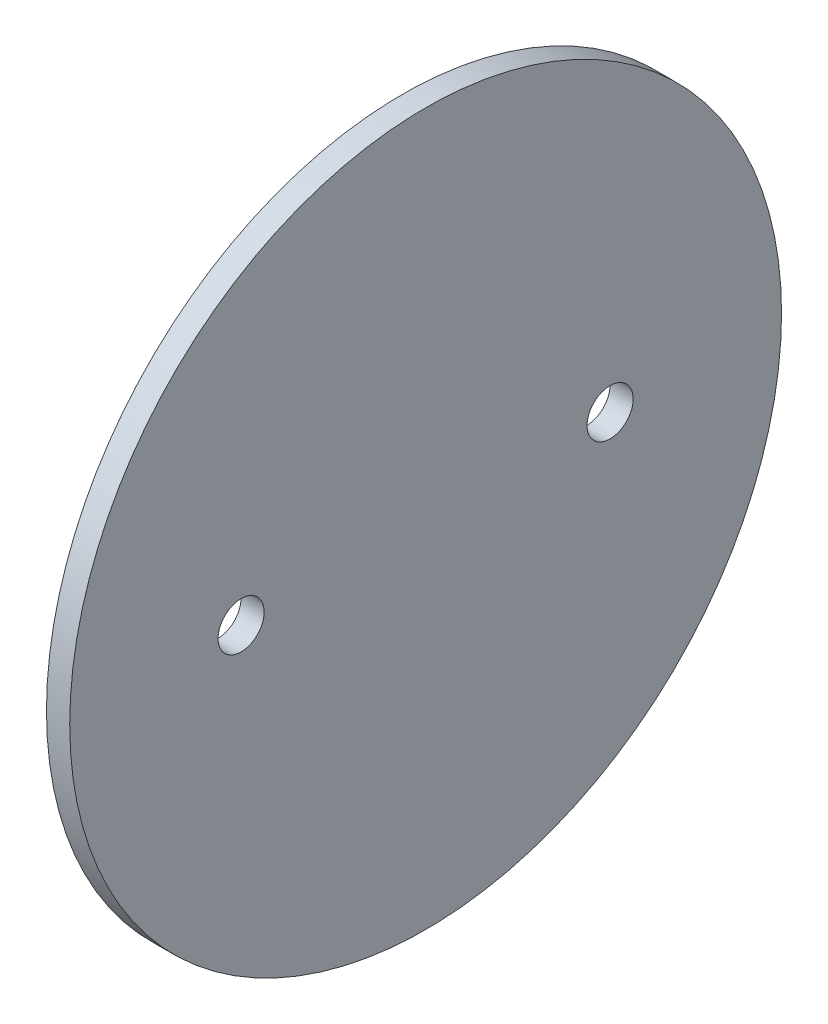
ISO-10303-21;
HEADER;
FILE_DESCRIPTION(('STEP AP214'),'2;1');
FILE_NAME('part.step','',(''),(''),'','','');
FILE_SCHEMA(('AUTOMOTIVE_DESIGN { 1 0 10303 214 1 1 1 1 }'));
ENDSEC;
DATA;
#1=APPLICATION_CONTEXT('core data for automotive mechanical design processes');
#2=APPLICATION_PROTOCOL_DEFINITION('international standard','automotive_design',2000,#1);
#3=PRODUCT_CONTEXT('',#1,'mechanical');
#4=PRODUCT('Part','Part','',(#3));
#5=PRODUCT_RELATED_PRODUCT_CATEGORY('part','',(#4));
#6=PRODUCT_DEFINITION_FORMATION('','',#4);
#7=PRODUCT_DEFINITION_CONTEXT('part definition',#1,'design');
#8=PRODUCT_DEFINITION('design','',#6,#7);
#9=PRODUCT_DEFINITION_SHAPE('','',#8);
#10=(LENGTH_UNIT() NAMED_UNIT(*) SI_UNIT(.MILLI.,.METRE.));
#11=(NAMED_UNIT(*) PLANE_ANGLE_UNIT() SI_UNIT($,.RADIAN.));
#12=(NAMED_UNIT(*) SI_UNIT($,.STERADIAN.) SOLID_ANGLE_UNIT());
#13=UNCERTAINTY_MEASURE_WITH_UNIT(LENGTH_MEASURE(1.E-05),#10,'distance_accuracy_value','');
#14=(GEOMETRIC_REPRESENTATION_CONTEXT(3) GLOBAL_UNCERTAINTY_ASSIGNED_CONTEXT((#13)) GLOBAL_UNIT_ASSIGNED_CONTEXT((#10,
#11,#12)) REPRESENTATION_CONTEXT('',''));
#15=CARTESIAN_POINT('',(0.,0.,0.));
#16=DIRECTION('',(0.,0.,1.));
#17=DIRECTION('',(1.,0.,0.));
#18=AXIS2_PLACEMENT_3D('',#15,#16,#17);
#19=CARTESIAN_POINT('',(0.8001,0.,0.));
#20=DIRECTION('',(1.,0.,0.));
#21=DIRECTION('',(0.,0.,-1.));
#22=AXIS2_PLACEMENT_3D('',#19,#20,#21);
#23=PLANE('',#22);
#24=CARTESIAN_POINT('',(0.8001,0.,-12.7));
#25=DIRECTION('',(1.,0.,0.));
#26=DIRECTION('',(0.,0.,-1.));
#27=AXIS2_PLACEMENT_3D('',#24,#25,#26);
#28=CIRCLE('',#27,1.5875);
#29=CARTESIAN_POINT('',(0.8001,0.,-14.2875));
#30=VERTEX_POINT('',#29);
#31=EDGE_CURVE('E40',#30,#30,#28,.T.);
#32=ORIENTED_EDGE('',*,*,#31,.F.);
#33=EDGE_LOOP('',(#32));
#34=FACE_BOUND('',#33,.T.);
#35=CARTESIAN_POINT('',(0.8001,0.,0.));
#36=DIRECTION('',(1.,0.,0.));
#37=DIRECTION('',(0.,0.,-1.));
#38=AXIS2_PLACEMENT_3D('',#35,#36,#37);
#39=CIRCLE('',#38,24.5);
#40=CARTESIAN_POINT('',(0.8001,0.,-24.5));
#41=VERTEX_POINT('',#40);
#42=EDGE_CURVE('E10',#41,#41,#39,.T.);
#43=ORIENTED_EDGE('',*,*,#42,.T.);
#44=EDGE_LOOP('',(#43));
#45=FACE_BOUND('',#44,.T.);
#46=CARTESIAN_POINT('',(0.8001,0.,12.7));
#47=DIRECTION('',(1.,0.,0.));
#48=DIRECTION('',(0.,0.,-1.));
#49=AXIS2_PLACEMENT_3D('',#46,#47,#48);
#50=CIRCLE('',#49,1.5875);
#51=CARTESIAN_POINT('',(0.8001,0.,11.1125));
#52=VERTEX_POINT('',#51);
#53=EDGE_CURVE('E49',#52,#52,#50,.T.);
#54=ORIENTED_EDGE('',*,*,#53,.F.);
#55=EDGE_LOOP('',(#54));
#56=FACE_BOUND('',#55,.T.);
#57=ADVANCED_FACE('F29',(#34,#45,#56),#23,.T.);
#58=CARTESIAN_POINT('',(-0.8001,0.,0.));
#59=DIRECTION('',(1.,0.,0.));
#60=DIRECTION('',(0.,0.,-1.));
#61=AXIS2_PLACEMENT_3D('',#58,#59,#60);
#62=PLANE('',#61);
#63=CARTESIAN_POINT('',(-0.8001,0.,-12.7));
#64=DIRECTION('',(1.,0.,0.));
#65=DIRECTION('',(0.,0.,-1.));
#66=AXIS2_PLACEMENT_3D('',#63,#64,#65);
#67=CIRCLE('',#66,1.5875);
#68=CARTESIAN_POINT('',(-0.8001,0.,-14.2875));
#69=VERTEX_POINT('',#68);
#70=EDGE_CURVE('E44',#69,#69,#67,.T.);
#71=ORIENTED_EDGE('',*,*,#70,.T.);
#72=EDGE_LOOP('',(#71));
#73=FACE_BOUND('',#72,.T.);
#74=CARTESIAN_POINT('',(-0.8001,0.,0.));
#75=DIRECTION('',(1.,0.,0.));
#76=DIRECTION('',(0.,0.,-1.));
#77=AXIS2_PLACEMENT_3D('',#74,#75,#76);
#78=CIRCLE('',#77,24.5);
#79=CARTESIAN_POINT('',(-0.8001,0.,-24.5));
#80=VERTEX_POINT('',#79);
#81=EDGE_CURVE('E36',#80,#80,#78,.T.);
#82=ORIENTED_EDGE('',*,*,#81,.F.);
#83=EDGE_LOOP('',(#82));
#84=FACE_BOUND('',#83,.T.);
#85=CARTESIAN_POINT('',(-0.8001,0.,12.7));
#86=DIRECTION('',(1.,0.,0.));
#87=DIRECTION('',(0.,0.,-1.));
#88=AXIS2_PLACEMENT_3D('',#85,#86,#87);
#89=CIRCLE('',#88,1.5875);
#90=CARTESIAN_POINT('',(-0.8001,0.,11.1125));
#91=VERTEX_POINT('',#90);
#92=EDGE_CURVE('E52',#91,#91,#89,.T.);
#93=ORIENTED_EDGE('',*,*,#92,.T.);
#94=EDGE_LOOP('',(#93));
#95=FACE_BOUND('',#94,.T.);
#96=ADVANCED_FACE('F56',(#73,#84,#95),#62,.F.);
#97=CARTESIAN_POINT('',(0.8001,0.,0.));
#98=DIRECTION('',(-1.,0.,0.));
#99=DIRECTION('',(0.,0.,1.));
#100=AXIS2_PLACEMENT_3D('',#97,#98,#99);
#101=CYLINDRICAL_SURFACE('',#100,24.5);
#102=ORIENTED_EDGE('',*,*,#42,.F.);
#103=EDGE_LOOP('',(#102));
#104=FACE_BOUND('',#103,.T.);
#105=ORIENTED_EDGE('',*,*,#81,.T.);
#106=EDGE_LOOP('',(#105));
#107=FACE_BOUND('',#106,.T.);
#108=ADVANCED_FACE('F31',(#104,#107),#101,.T.);
#109=CARTESIAN_POINT('',(0.8001,0.,-12.7));
#110=DIRECTION('',(-1.,0.,0.));
#111=DIRECTION('',(0.,0.,1.));
#112=AXIS2_PLACEMENT_3D('',#109,#110,#111);
#113=CYLINDRICAL_SURFACE('',#112,1.5875);
#114=ORIENTED_EDGE('',*,*,#31,.T.);
#115=EDGE_LOOP('',(#114));
#116=FACE_BOUND('',#115,.T.);
#117=ORIENTED_EDGE('',*,*,#70,.F.);
#118=EDGE_LOOP('',(#117));
#119=FACE_BOUND('',#118,.T.);
#120=ADVANCED_FACE('F60',(#116,#119),#113,.F.);
#121=CARTESIAN_POINT('',(0.8001,0.,12.7));
#122=DIRECTION('',(-1.,0.,0.));
#123=DIRECTION('',(0.,0.,1.));
#124=AXIS2_PLACEMENT_3D('',#121,#122,#123);
#125=CYLINDRICAL_SURFACE('',#124,1.5875);
#126=ORIENTED_EDGE('',*,*,#53,.T.);
#127=EDGE_LOOP('',(#126));
#128=FACE_BOUND('',#127,.T.);
#129=ORIENTED_EDGE('',*,*,#92,.F.);
#130=EDGE_LOOP('',(#129));
#131=FACE_BOUND('',#130,.T.);
#132=ADVANCED_FACE('F58',(#128,#131),#125,.F.);
#133=CLOSED_SHELL('',(#57,#96,#108,#120,#132));
#134=MANIFOLD_SOLID_BREP('B2',#133);
#135=ADVANCED_BREP_SHAPE_REPRESENTATION('',(#18,#134),#14);
#136=SHAPE_DEFINITION_REPRESENTATION(#9,#135);
ENDSEC;
END-ISO-10303-21;
